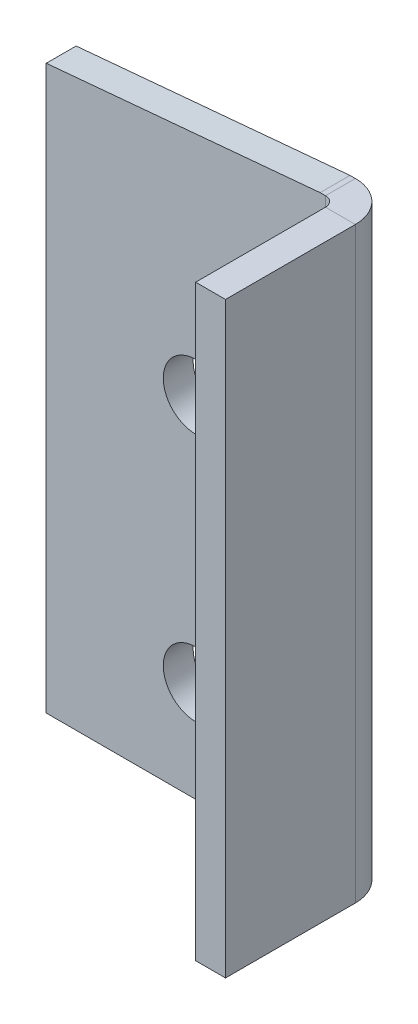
ISO-10303-21;
HEADER;
FILE_DESCRIPTION(('STEP AP214'),'2;1');
FILE_NAME('part.step','',(''),(''),'','','');
FILE_SCHEMA(('AUTOMOTIVE_DESIGN { 1 0 10303 214 1 1 1 1 }'));
ENDSEC;
DATA;
#1=APPLICATION_CONTEXT('core data for automotive mechanical design processes');
#2=APPLICATION_PROTOCOL_DEFINITION('international standard','automotive_design',2000,#1);
#3=PRODUCT_CONTEXT('',#1,'mechanical');
#4=PRODUCT('Part','Part','',(#3));
#5=PRODUCT_RELATED_PRODUCT_CATEGORY('part','',(#4));
#6=PRODUCT_DEFINITION_FORMATION('','',#4);
#7=PRODUCT_DEFINITION_CONTEXT('part definition',#1,'design');
#8=PRODUCT_DEFINITION('design','',#6,#7);
#9=PRODUCT_DEFINITION_SHAPE('','',#8);
#10=(LENGTH_UNIT() NAMED_UNIT(*) SI_UNIT(.MILLI.,.METRE.));
#11=(NAMED_UNIT(*) PLANE_ANGLE_UNIT() SI_UNIT($,.RADIAN.));
#12=(NAMED_UNIT(*) SI_UNIT($,.STERADIAN.) SOLID_ANGLE_UNIT());
#13=UNCERTAINTY_MEASURE_WITH_UNIT(LENGTH_MEASURE(1.E-05),#10,'distance_accuracy_value','');
#14=(GEOMETRIC_REPRESENTATION_CONTEXT(3) GLOBAL_UNCERTAINTY_ASSIGNED_CONTEXT((#13)) GLOBAL_UNIT_ASSIGNED_CONTEXT((#10,
#11,#12)) REPRESENTATION_CONTEXT('',''));
#15=CARTESIAN_POINT('',(0.,0.,0.));
#16=DIRECTION('',(0.,0.,1.));
#17=DIRECTION('',(1.,0.,0.));
#18=AXIS2_PLACEMENT_3D('',#15,#16,#17);
#19=CARTESIAN_POINT('',(-31.9269908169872,118.,-0.926990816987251));
#20=DIRECTION('',(0.,-1.,0.));
#21=DIRECTION('',(1.,0.,0.));
#22=AXIS2_PLACEMENT_3D('',#19,#20,#21);
#23=PLANE('',#22);
#24=DIRECTION('',(0.,0.,-1.));
#25=VECTOR('',#24,1.);
#26=CARTESIAN_POINT('',(-25.9269908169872,118.,-0.92699081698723));
#27=LINE('',#26,#25);
#28=CARTESIAN_POINT('',(-25.9269908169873,118.,34.0730091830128));
#29=VERTEX_POINT('',#28);
#30=CARTESIAN_POINT('',(-25.9269908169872,118.,8.00000000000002));
#31=VERTEX_POINT('',#30);
#32=EDGE_CURVE('E93',#29,#31,#27,.T.);
#33=ORIENTED_EDGE('',*,*,#32,.T.);
#34=DIRECTION('',(-1.,0.,0.));
#35=VECTOR('',#34,1.);
#36=CARTESIAN_POINT('',(-31.9269908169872,118.,8.));
#37=LINE('',#36,#35);
#38=CARTESIAN_POINT('',(-31.9269908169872,118.,8.00000000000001));
#39=VERTEX_POINT('',#38);
#40=EDGE_CURVE('E108',#31,#39,#37,.T.);
#41=ORIENTED_EDGE('',*,*,#40,.T.);
#42=DIRECTION('',(0.,0.,-1.));
#43=VECTOR('',#42,1.);
#44=CARTESIAN_POINT('',(-31.9269908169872,118.,-0.926990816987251));
#45=LINE('',#44,#43);
#46=CARTESIAN_POINT('',(-31.9269908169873,118.,34.0730091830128));
#47=VERTEX_POINT('',#46);
#48=EDGE_CURVE('E49',#47,#39,#45,.T.);
#49=ORIENTED_EDGE('',*,*,#48,.F.);
#50=DIRECTION('',(1.,0.,0.));
#51=VECTOR('',#50,1.);
#52=CARTESIAN_POINT('',(-31.9269908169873,118.,34.0730091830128));
#53=LINE('',#52,#51);
#54=EDGE_CURVE('E86',#47,#29,#53,.T.);
#55=ORIENTED_EDGE('',*,*,#54,.T.);
#56=EDGE_LOOP('',(#33,#41,#49,#55));
#57=FACE_BOUND('',#56,.T.);
#58=ADVANCED_FACE('F45',(#57),#23,.F.);
#59=CARTESIAN_POINT('',(-31.926990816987,0.,-55.9269908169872));
#60=DIRECTION('',(0.,1.,0.));
#61=DIRECTION('',(-1.,0.,0.));
#62=AXIS2_PLACEMENT_3D('',#59,#60,#61);
#63=PLANE('',#62);
#64=DIRECTION('',(0.,0.,1.));
#65=VECTOR('',#64,1.);
#66=CARTESIAN_POINT('',(-31.926990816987,0.,-55.9269908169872));
#67=LINE('',#66,#65);
#68=CARTESIAN_POINT('',(-31.9269908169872,0.,7.99999999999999));
#69=VERTEX_POINT('',#68);
#70=CARTESIAN_POINT('',(-31.9269908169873,0.,34.0730091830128));
#71=VERTEX_POINT('',#70);
#72=EDGE_CURVE('E102',#69,#71,#67,.T.);
#73=ORIENTED_EDGE('',*,*,#72,.F.);
#74=DIRECTION('',(1.,0.,0.));
#75=VECTOR('',#74,1.);
#76=CARTESIAN_POINT('',(-31.9269908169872,0.,8.));
#77=LINE('',#76,#75);
#78=CARTESIAN_POINT('',(-25.9269908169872,0.,7.99999999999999));
#79=VERTEX_POINT('',#78);
#80=EDGE_CURVE('E12',#69,#79,#77,.T.);
#81=ORIENTED_EDGE('',*,*,#80,.T.);
#82=DIRECTION('',(0.,0.,1.));
#83=VECTOR('',#82,1.);
#84=CARTESIAN_POINT('',(-25.926990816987,0.,-55.9269908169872));
#85=LINE('',#84,#83);
#86=CARTESIAN_POINT('',(-25.9269908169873,0.,34.0730091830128));
#87=VERTEX_POINT('',#86);
#88=EDGE_CURVE('E94',#79,#87,#85,.T.);
#89=ORIENTED_EDGE('',*,*,#88,.T.);
#90=DIRECTION('',(1.,0.,0.));
#91=VECTOR('',#90,1.);
#92=CARTESIAN_POINT('',(-31.9269908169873,0.,34.0730091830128));
#93=LINE('',#92,#91);
#94=EDGE_CURVE('E89',#71,#87,#93,.T.);
#95=ORIENTED_EDGE('',*,*,#94,.F.);
#96=EDGE_LOOP('',(#73,#81,#89,#95));
#97=FACE_BOUND('',#96,.T.);
#98=ADVANCED_FACE('F47',(#97),#63,.F.);
#99=CARTESIAN_POINT('',(-31.926990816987,118.,-55.9269908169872));
#100=DIRECTION('',(1.,0.,0.));
#101=DIRECTION('',(0.,0.,-1.));
#102=AXIS2_PLACEMENT_3D('',#99,#100,#101);
#103=PLANE('',#102);
#104=ORIENTED_EDGE('',*,*,#48,.T.);
#105=DIRECTION('',(0.,-1.,0.));
#106=VECTOR('',#105,1.);
#107=CARTESIAN_POINT('',(-31.9269908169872,118.,8.));
#108=LINE('',#107,#106);
#109=EDGE_CURVE('E110',#39,#69,#108,.T.);
#110=ORIENTED_EDGE('',*,*,#109,.T.);
#111=ORIENTED_EDGE('',*,*,#72,.T.);
#112=DIRECTION('',(0.,1.,0.));
#113=VECTOR('',#112,1.);
#114=CARTESIAN_POINT('',(-31.9269908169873,0.,34.0730091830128));
#115=LINE('',#114,#113);
#116=EDGE_CURVE('E70',#71,#47,#115,.T.);
#117=ORIENTED_EDGE('',*,*,#116,.T.);
#118=EDGE_LOOP('',(#104,#110,#111,#117));
#119=FACE_BOUND('',#118,.T.);
#120=ADVANCED_FACE('F260',(#119),#103,.F.);
#121=CARTESIAN_POINT('',(-25.926990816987,118.,-55.9269908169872));
#122=DIRECTION('',(1.,0.,0.));
#123=DIRECTION('',(0.,0.,-1.));
#124=AXIS2_PLACEMENT_3D('',#121,#122,#123);
#125=PLANE('',#124);
#126=DIRECTION('',(0.,-1.,0.));
#127=VECTOR('',#126,1.);
#128=CARTESIAN_POINT('',(-25.9269908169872,118.,8.00000000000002));
#129=LINE('',#128,#127);
#130=EDGE_CURVE('E54',#31,#79,#129,.T.);
#131=ORIENTED_EDGE('',*,*,#130,.F.);
#132=ORIENTED_EDGE('',*,*,#32,.F.);
#133=DIRECTION('',(0.,1.,0.));
#134=VECTOR('',#133,1.);
#135=CARTESIAN_POINT('',(-25.9269908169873,0.,34.0730091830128));
#136=LINE('',#135,#134);
#137=EDGE_CURVE('E83',#87,#29,#136,.T.);
#138=ORIENTED_EDGE('',*,*,#137,.F.);
#139=ORIENTED_EDGE('',*,*,#88,.F.);
#140=EDGE_LOOP('',(#131,#132,#138,#139));
#141=FACE_BOUND('',#140,.T.);
#142=ADVANCED_FACE('F101',(#141),#125,.T.);
#143=CARTESIAN_POINT('',(-31.9269908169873,0.,34.0730091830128));
#144=DIRECTION('',(0.,0.,-1.));
#145=DIRECTION('',(-1.,0.,0.));
#146=AXIS2_PLACEMENT_3D('',#143,#144,#145);
#147=PLANE('',#146);
#148=ORIENTED_EDGE('',*,*,#137,.T.);
#149=ORIENTED_EDGE('',*,*,#54,.F.);
#150=ORIENTED_EDGE('',*,*,#116,.F.);
#151=ORIENTED_EDGE('',*,*,#94,.T.);
#152=EDGE_LOOP('',(#148,#149,#150,#151));
#153=FACE_BOUND('',#152,.T.);
#154=ADVANCED_FACE('F85',(#153),#147,.F.);
#155=CARTESIAN_POINT('',(-60.,70.,6.));
#156=DIRECTION('',(0.,0.,-1.));
#157=DIRECTION('',(-1.,0.,0.));
#158=AXIS2_PLACEMENT_3D('',#155,#156,#157);
#159=CYLINDRICAL_SURFACE('',#158,6.50000000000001);
#160=CARTESIAN_POINT('',(-60.,70.,6.));
#161=DIRECTION('',(0.,0.,1.));
#162=DIRECTION('',(1.,0.,0.));
#163=AXIS2_PLACEMENT_3D('',#160,#161,#162);
#164=CIRCLE('',#163,6.50000000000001);
#165=CARTESIAN_POINT('',(-53.5,70.,6.));
#166=VERTEX_POINT('',#165);
#167=EDGE_CURVE('E125',#166,#166,#164,.T.);
#168=ORIENTED_EDGE('',*,*,#167,.T.);
#169=EDGE_LOOP('',(#168));
#170=FACE_BOUND('',#169,.T.);
#171=CARTESIAN_POINT('',(-60.,70.,0.));
#172=DIRECTION('',(0.,0.,1.));
#173=DIRECTION('',(1.,0.,0.));
#174=AXIS2_PLACEMENT_3D('',#171,#172,#173);
#175=CIRCLE('',#174,6.50000000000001);
#176=CARTESIAN_POINT('',(-53.5,70.,0.));
#177=VERTEX_POINT('',#176);
#178=EDGE_CURVE('E161',#177,#177,#175,.T.);
#179=ORIENTED_EDGE('',*,*,#178,.F.);
#180=EDGE_LOOP('',(#179));
#181=FACE_BOUND('',#180,.T.);
#182=ADVANCED_FACE('F252',(#170,#181),#159,.F.);
#183=CARTESIAN_POINT('',(-60.,20.,6.));
#184=DIRECTION('',(0.,0.,-1.));
#185=DIRECTION('',(-1.,0.,0.));
#186=AXIS2_PLACEMENT_3D('',#183,#184,#185);
#187=CYLINDRICAL_SURFACE('',#186,6.5);
#188=CARTESIAN_POINT('',(-60.,20.,6.));
#189=DIRECTION('',(0.,0.,1.));
#190=DIRECTION('',(1.,0.,0.));
#191=AXIS2_PLACEMENT_3D('',#188,#189,#190);
#192=CIRCLE('',#191,6.5);
#193=CARTESIAN_POINT('',(-53.5,20.,6.));
#194=VERTEX_POINT('',#193);
#195=EDGE_CURVE('E128',#194,#194,#192,.T.);
#196=ORIENTED_EDGE('',*,*,#195,.T.);
#197=EDGE_LOOP('',(#196));
#198=FACE_BOUND('',#197,.T.);
#199=CARTESIAN_POINT('',(-60.,20.,0.));
#200=DIRECTION('',(0.,0.,1.));
#201=DIRECTION('',(1.,0.,0.));
#202=AXIS2_PLACEMENT_3D('',#199,#200,#201);
#203=CIRCLE('',#202,6.5);
#204=CARTESIAN_POINT('',(-53.5,20.,0.));
#205=VERTEX_POINT('',#204);
#206=EDGE_CURVE('E158',#205,#205,#203,.T.);
#207=ORIENTED_EDGE('',*,*,#206,.F.);
#208=EDGE_LOOP('',(#207));
#209=FACE_BOUND('',#208,.T.);
#210=ADVANCED_FACE('F245',(#198,#209),#187,.F.);
#211=CARTESIAN_POINT('',(-90.,0.,6.));
#212=DIRECTION('',(1.,0.,0.));
#213=DIRECTION('',(0.,0.,-1.));
#214=AXIS2_PLACEMENT_3D('',#211,#212,#213);
#215=PLANE('',#214);
#216=DIRECTION('',(0.,-1.,0.));
#217=VECTOR('',#216,1.);
#218=CARTESIAN_POINT('',(-90.,0.,0.));
#219=LINE('',#218,#217);
#220=CARTESIAN_POINT('',(-90.,113.,0.));
#221=VERTEX_POINT('',#220);
#222=CARTESIAN_POINT('',(-90.,0.,0.));
#223=VERTEX_POINT('',#222);
#224=EDGE_CURVE('E131',#221,#223,#219,.T.);
#225=ORIENTED_EDGE('',*,*,#224,.T.);
#226=DIRECTION('',(0.,0.,-1.));
#227=VECTOR('',#226,1.);
#228=CARTESIAN_POINT('',(-90.,0.,6.));
#229=LINE('',#228,#227);
#230=CARTESIAN_POINT('',(-90.,0.,6.));
#231=VERTEX_POINT('',#230);
#232=EDGE_CURVE('E167',#231,#223,#229,.T.);
#233=ORIENTED_EDGE('',*,*,#232,.F.);
#234=DIRECTION('',(0.,-1.,0.));
#235=VECTOR('',#234,1.);
#236=CARTESIAN_POINT('',(-90.,0.,6.));
#237=LINE('',#236,#235);
#238=CARTESIAN_POINT('',(-90.,113.,6.));
#239=VERTEX_POINT('',#238);
#240=EDGE_CURVE('E149',#239,#231,#237,.T.);
#241=ORIENTED_EDGE('',*,*,#240,.F.);
#242=DIRECTION('',(0.,0.,-1.));
#243=VECTOR('',#242,1.);
#244=CARTESIAN_POINT('',(-90.,113.,6.));
#245=LINE('',#244,#243);
#246=EDGE_CURVE('E134',#239,#221,#245,.T.);
#247=ORIENTED_EDGE('',*,*,#246,.T.);
#248=EDGE_LOOP('',(#225,#233,#241,#247));
#249=FACE_BOUND('',#248,.T.);
#250=ADVANCED_FACE('F243',(#249),#215,.F.);
#251=CARTESIAN_POINT('',(-90.,113.,6.));
#252=DIRECTION('',(0.0905357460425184,-0.995893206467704,0.));
#253=DIRECTION('',(0.995893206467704,0.0905357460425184,0.));
#254=AXIS2_PLACEMENT_3D('',#251,#252,#253);
#255=PLANE('',#254);
#256=DIRECTION('',(-0.995893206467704,-0.0905357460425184,0.));
#257=VECTOR('',#256,1.);
#258=CARTESIAN_POINT('',(-90.,113.,0.));
#259=LINE('',#258,#257);
#260=CARTESIAN_POINT('',(-35.,118.,0.));
#261=VERTEX_POINT('',#260);
#262=EDGE_CURVE('E137',#261,#221,#259,.T.);
#263=ORIENTED_EDGE('',*,*,#262,.T.);
#264=ORIENTED_EDGE('',*,*,#246,.F.);
#265=DIRECTION('',(-0.995893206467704,-0.0905357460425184,0.));
#266=VECTOR('',#265,1.);
#267=CARTESIAN_POINT('',(-90.,113.,6.));
#268=LINE('',#267,#266);
#269=CARTESIAN_POINT('',(-35.,118.,6.));
#270=VERTEX_POINT('',#269);
#271=EDGE_CURVE('E146',#270,#239,#268,.T.);
#272=ORIENTED_EDGE('',*,*,#271,.F.);
#273=DIRECTION('',(0.,0.,-1.));
#274=VECTOR('',#273,1.);
#275=CARTESIAN_POINT('',(-35.,118.,6.));
#276=LINE('',#275,#274);
#277=EDGE_CURVE('E140',#270,#261,#276,.T.);
#278=ORIENTED_EDGE('',*,*,#277,.T.);
#279=EDGE_LOOP('',(#263,#264,#272,#278));
#280=FACE_BOUND('',#279,.T.);
#281=ADVANCED_FACE('F241',(#280),#255,.F.);
#282=CARTESIAN_POINT('',(-90.,118.,6.));
#283=DIRECTION('',(0.,0.,-1.));
#284=DIRECTION('',(-1.,0.,0.));
#285=AXIS2_PLACEMENT_3D('',#282,#283,#284);
#286=PLANE('',#285);
#287=DIRECTION('',(0.,-1.,0.));
#288=VECTOR('',#287,1.);
#289=CARTESIAN_POINT('',(-33.9269908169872,118.,6.));
#290=LINE('',#289,#288);
#291=CARTESIAN_POINT('',(-33.9269908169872,118.,6.));
#292=VERTEX_POINT('',#291);
#293=CARTESIAN_POINT('',(-33.9269908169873,0.,6.));
#294=VERTEX_POINT('',#293);
#295=EDGE_CURVE('E115',#292,#294,#290,.T.);
#296=ORIENTED_EDGE('',*,*,#295,.F.);
#297=DIRECTION('',(-1.,0.,0.));
#298=VECTOR('',#297,1.);
#299=CARTESIAN_POINT('',(-35.,118.,6.));
#300=LINE('',#299,#298);
#301=EDGE_CURVE('E143',#292,#270,#300,.T.);
#302=ORIENTED_EDGE('',*,*,#301,.T.);
#303=ORIENTED_EDGE('',*,*,#271,.T.);
#304=ORIENTED_EDGE('',*,*,#240,.T.);
#305=DIRECTION('',(1.,0.,0.));
#306=VECTOR('',#305,1.);
#307=CARTESIAN_POINT('',(-90.,0.,6.));
#308=LINE('',#307,#306);
#309=EDGE_CURVE('E152',#231,#294,#308,.T.);
#310=ORIENTED_EDGE('',*,*,#309,.T.);
#311=EDGE_LOOP('',(#296,#302,#303,#304,#310));
#312=FACE_BOUND('',#311,.T.);
#313=ORIENTED_EDGE('',*,*,#195,.F.);
#314=EDGE_LOOP('',(#313));
#315=FACE_BOUND('',#314,.T.);
#316=ORIENTED_EDGE('',*,*,#167,.F.);
#317=EDGE_LOOP('',(#316));
#318=FACE_BOUND('',#317,.T.);
#319=ADVANCED_FACE('F221',(#312,#315,#318),#286,.F.);
#320=CARTESIAN_POINT('',(-35.,118.,6.));
#321=DIRECTION('',(0.,-1.,0.));
#322=DIRECTION('',(0.,0.,-1.));
#323=AXIS2_PLACEMENT_3D('',#320,#321,#322);
#324=PLANE('',#323);
#325=DIRECTION('',(0.,0.,1.));
#326=VECTOR('',#325,1.);
#327=CARTESIAN_POINT('',(-33.9269908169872,118.,6.));
#328=LINE('',#327,#326);
#329=CARTESIAN_POINT('',(-33.9269908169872,118.,0.));
#330=VERTEX_POINT('',#329);
#331=EDGE_CURVE('E122',#330,#292,#328,.T.);
#332=ORIENTED_EDGE('',*,*,#331,.F.);
#333=DIRECTION('',(-1.,0.,0.));
#334=VECTOR('',#333,1.);
#335=CARTESIAN_POINT('',(-35.,118.,0.));
#336=LINE('',#335,#334);
#337=EDGE_CURVE('E155',#330,#261,#336,.T.);
#338=ORIENTED_EDGE('',*,*,#337,.T.);
#339=ORIENTED_EDGE('',*,*,#277,.F.);
#340=ORIENTED_EDGE('',*,*,#301,.F.);
#341=EDGE_LOOP('',(#332,#338,#339,#340));
#342=FACE_BOUND('',#341,.T.);
#343=ADVANCED_FACE('F237',(#342),#324,.F.);
#344=CARTESIAN_POINT('',(-90.,118.,0.));
#345=DIRECTION('',(0.,0.,-1.));
#346=DIRECTION('',(-1.,0.,0.));
#347=AXIS2_PLACEMENT_3D('',#344,#345,#346);
#348=PLANE('',#347);
#349=ORIENTED_EDGE('',*,*,#206,.T.);
#350=EDGE_LOOP('',(#349));
#351=FACE_BOUND('',#350,.T.);
#352=ORIENTED_EDGE('',*,*,#178,.T.);
#353=EDGE_LOOP('',(#352));
#354=FACE_BOUND('',#353,.T.);
#355=ORIENTED_EDGE('',*,*,#337,.F.);
#356=DIRECTION('',(0.,-1.,0.));
#357=VECTOR('',#356,1.);
#358=CARTESIAN_POINT('',(-33.9269908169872,118.,0.));
#359=LINE('',#358,#357);
#360=CARTESIAN_POINT('',(-33.9269908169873,0.,0.));
#361=VERTEX_POINT('',#360);
#362=EDGE_CURVE('E164',#330,#361,#359,.T.);
#363=ORIENTED_EDGE('',*,*,#362,.T.);
#364=DIRECTION('',(1.,0.,0.));
#365=VECTOR('',#364,1.);
#366=CARTESIAN_POINT('',(-90.,0.,0.));
#367=LINE('',#366,#365);
#368=EDGE_CURVE('E105',#223,#361,#367,.T.);
#369=ORIENTED_EDGE('',*,*,#368,.F.);
#370=ORIENTED_EDGE('',*,*,#224,.F.);
#371=ORIENTED_EDGE('',*,*,#262,.F.);
#372=EDGE_LOOP('',(#355,#363,#369,#370,#371));
#373=FACE_BOUND('',#372,.T.);
#374=ADVANCED_FACE('F232',(#351,#354,#373),#348,.T.);
#375=CARTESIAN_POINT('',(-90.,0.,6.));
#376=DIRECTION('',(0.,1.,0.));
#377=DIRECTION('',(0.,0.,1.));
#378=AXIS2_PLACEMENT_3D('',#375,#376,#377);
#379=PLANE('',#378);
#380=DIRECTION('',(0.,0.,-1.));
#381=VECTOR('',#380,1.);
#382=CARTESIAN_POINT('',(-33.9269908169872,0.,6.));
#383=LINE('',#382,#381);
#384=EDGE_CURVE('E118',#294,#361,#383,.T.);
#385=ORIENTED_EDGE('',*,*,#384,.F.);
#386=ORIENTED_EDGE('',*,*,#309,.F.);
#387=ORIENTED_EDGE('',*,*,#232,.T.);
#388=ORIENTED_EDGE('',*,*,#368,.T.);
#389=EDGE_LOOP('',(#385,#386,#387,#388));
#390=FACE_BOUND('',#389,.T.);
#391=ADVANCED_FACE('F226',(#390),#379,.F.);
#392=CARTESIAN_POINT('',(-33.9269908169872,118.,8.));
#393=DIRECTION('',(0.,-1.,0.));
#394=DIRECTION('',(0.,0.,-1.));
#395=AXIS2_PLACEMENT_3D('',#392,#393,#394);
#396=PLANE('',#395);
#397=ORIENTED_EDGE('',*,*,#40,.F.);
#398=CARTESIAN_POINT('',(-33.9269908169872,118.,8.));
#399=DIRECTION('',(0.,1.,0.));
#400=DIRECTION('',(0.,0.,1.));
#401=AXIS2_PLACEMENT_3D('',#398,#399,#400);
#402=CIRCLE('',#401,8.);
#403=EDGE_CURVE('E172',#31,#330,#402,.T.);
#404=ORIENTED_EDGE('',*,*,#403,.T.);
#405=ORIENTED_EDGE('',*,*,#331,.T.);
#406=CARTESIAN_POINT('',(-33.9269908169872,118.,8.));
#407=DIRECTION('',(0.,1.,0.));
#408=DIRECTION('',(0.,0.,1.));
#409=AXIS2_PLACEMENT_3D('',#406,#407,#408);
#410=CIRCLE('',#409,2.);
#411=EDGE_CURVE('E177',#39,#292,#410,.T.);
#412=ORIENTED_EDGE('',*,*,#411,.F.);
#413=EDGE_LOOP('',(#397,#404,#405,#412));
#414=FACE_BOUND('',#413,.T.);
#415=ADVANCED_FACE('F195',(#414),#396,.F.);
#416=CARTESIAN_POINT('',(-33.9269908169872,0.,8.));
#417=DIRECTION('',(0.,1.,0.));
#418=DIRECTION('',(0.,0.,1.));
#419=AXIS2_PLACEMENT_3D('',#416,#417,#418);
#420=PLANE('',#419);
#421=ORIENTED_EDGE('',*,*,#384,.T.);
#422=CARTESIAN_POINT('',(-33.9269908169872,0.,8.));
#423=DIRECTION('',(0.,1.,0.));
#424=DIRECTION('',(0.,0.,1.));
#425=AXIS2_PLACEMENT_3D('',#422,#423,#424);
#426=CIRCLE('',#425,8.);
#427=EDGE_CURVE('E175',#361,#79,#426,.F.);
#428=ORIENTED_EDGE('',*,*,#427,.T.);
#429=ORIENTED_EDGE('',*,*,#80,.F.);
#430=CARTESIAN_POINT('',(-33.9269908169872,0.,8.));
#431=DIRECTION('',(0.,-1.,0.));
#432=DIRECTION('',(0.,0.,-1.));
#433=AXIS2_PLACEMENT_3D('',#430,#431,#432);
#434=CIRCLE('',#433,2.);
#435=EDGE_CURVE('E119',#294,#69,#434,.T.);
#436=ORIENTED_EDGE('',*,*,#435,.F.);
#437=EDGE_LOOP('',(#421,#428,#429,#436));
#438=FACE_BOUND('',#437,.T.);
#439=ADVANCED_FACE('F228',(#438),#420,.F.);
#440=CARTESIAN_POINT('',(-33.9269908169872,-59.413196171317,8.));
#441=DIRECTION('',(0.,1.,0.));
#442=DIRECTION('',(0.,0.,1.));
#443=AXIS2_PLACEMENT_3D('',#440,#441,#442);
#444=CYLINDRICAL_SURFACE('',#443,2.);
#445=ORIENTED_EDGE('',*,*,#435,.T.);
#446=ORIENTED_EDGE('',*,*,#109,.F.);
#447=ORIENTED_EDGE('',*,*,#411,.T.);
#448=ORIENTED_EDGE('',*,*,#295,.T.);
#449=EDGE_LOOP('',(#445,#446,#447,#448));
#450=FACE_BOUND('',#449,.T.);
#451=ADVANCED_FACE('F185',(#450),#444,.F.);
#452=CARTESIAN_POINT('',(-33.9269908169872,-59.413196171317,8.));
#453=DIRECTION('',(0.,1.,0.));
#454=DIRECTION('',(0.,0.,1.));
#455=AXIS2_PLACEMENT_3D('',#452,#453,#454);
#456=CYLINDRICAL_SURFACE('',#455,8.);
#457=ORIENTED_EDGE('',*,*,#427,.F.);
#458=ORIENTED_EDGE('',*,*,#362,.F.);
#459=ORIENTED_EDGE('',*,*,#403,.F.);
#460=ORIENTED_EDGE('',*,*,#130,.T.);
#461=EDGE_LOOP('',(#457,#458,#459,#460));
#462=FACE_BOUND('',#461,.T.);
#463=ADVANCED_FACE('F230',(#462),#456,.T.);
#464=CLOSED_SHELL('',(#58,#98,#120,#142,#154,#182,#210,#250,#281,#319,#343,#374,#391,#415,#439,
#451,#463));
#465=MANIFOLD_SOLID_BREP('B2',#464);
#466=ADVANCED_BREP_SHAPE_REPRESENTATION('',(#18,#465),#14);
#467=SHAPE_DEFINITION_REPRESENTATION(#9,#466);
ENDSEC;
END-ISO-10303-21;
